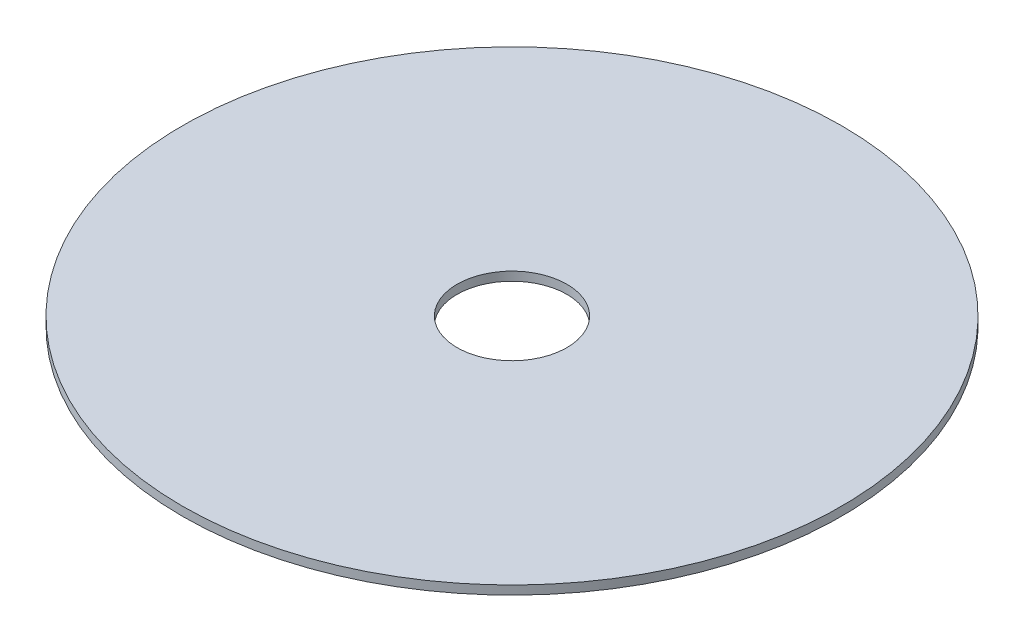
from build123d import *

# Parameters (mm, degrees)
SKETCH1_R           = 28.575
SKETCH1_R_2         = 4.7625
BOSS_EXTRUDE1_DEPTH = 0.762


with BuildPart() as part:
    # Sketch1 → Boss-Extrude1 (new body)
    with BuildSketch(Plane(origin=(0, 0, 0), x_dir=(1, 0, 0), z_dir=(0, 1, 0))):
        with Locations(Location((0, 0, 0), (0, 0, 90))):
            Circle(SKETCH1_R)
        with Locations(Location((0, 0, 0), (0, 0, 90))):
            Circle(SKETCH1_R_2, mode=Mode.SUBTRACT)
    extrude(amount=BOSS_EXTRUDE1_DEPTH)


solid = part.part
